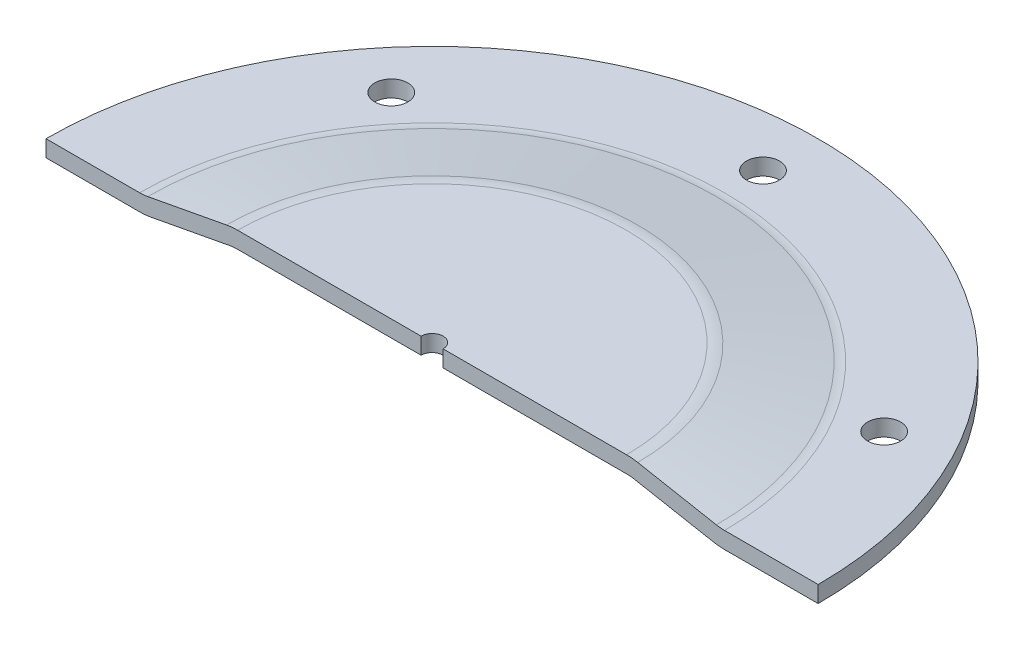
from build123d import *

# Parameters (mm, degrees)
ENL_V_MAT_EXTRU_2_REACH      = 72.848
ESQUISSE5_R                  = 1.5
R_P_TITION_CIRCULAIRE1_COUNT = 2
R_P_TITION_CIRCULAIRE1_ANGLE = 60
R_P_TITION_CIRCULAIRE2_COUNT = 2
R_P_TITION_CIRCULAIRE2_ANGLE = 50
ENL_V_MAT_EXTRU_3_REACH      = 51.588
ESQUISSE6_R                  = 1
ESQUISSE2_W                  = 35
ESQUISSE2_H                  = 3
COUPE_ANGLE                  = 180


with BuildPart() as part:
    # Esquisse1 → R_volution1 (revolve)
    with BuildSketch(Plane.XY):
        with BuildLine():
            Line((-35, 0), (-26.511171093, 0))
            ThreePointArc((-26.511171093, 0), (-26.141005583, 0.017164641), (-25.774016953, 0.068511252))
            Line((-25.774016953, 0.068511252), (-18.641826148, 1.405797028))
            ThreePointArc((-18.641826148, 1.405797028), (-18.137216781, 1.476398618), (-17.628239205, 1.5))
            Line((-17.628239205, 1.5), (0, 1.5))
            Line((0, 1.5), (0, 0))
            Line((0, 0), (-17.628239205, 0))
            ThreePointArc((-17.628239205, 0), (-17.998404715, -0.017164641), (-18.365393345, -0.068511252))
            Line((-18.365393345, -0.068511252), (-25.49758415, -1.405797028))
            ThreePointArc((-25.49758415, -1.405797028), (-26.002193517, -1.476398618), (-26.511171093, -1.5))
            Line((-26.511171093, -1.5), (-35, -1.5))
            Line((-35, -1.5), (-35, 0))
        make_face()
    revolve(axis=Axis((0, 1.5, 0), (0, 1, 0)))

    # Esquisse5 → Enl_v. mat.-Extru.2 (cut, up to next)
    with BuildSketch(Plane(origin=(-9.442910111, 0, -20.154109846), x_dir=(-1, 0, 0), z_dir=(0, 1, 0)), mode=Mode.PRIVATE) as enl_v_mat_extru_2_sk1:
        with Locations(Location((-9.442910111, -9.845890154, 0), (0, 0, 90))):
            Circle(ESQUISSE5_R)
    enl_v_mat_extru_2_tool1 = extrude(enl_v_mat_extru_2_sk1.sketch, amount=-ENL_V_MAT_EXTRU_2_REACH, mode=Mode.PRIVATE) & part.part
    enl_v_mat_extru_2 = enl_v_mat_extru_2_tool1.solids().sort_by_distance((0, 0, -30))[0]
    add(enl_v_mat_extru_2, mode=Mode.SUBTRACT)

    # R_p_tition circulaire1: Enl_v. mat.-Extru.2 ×2 about axis
    r_p_tition_circulaire1_axis = Axis((0, 0, 0), (0, -1, 0))
    for i in range(1, R_P_TITION_CIRCULAIRE1_COUNT):
        add(enl_v_mat_extru_2.rotate(r_p_tition_circulaire1_axis, i * R_P_TITION_CIRCULAIRE1_ANGLE / (R_P_TITION_CIRCULAIRE1_COUNT - 1)), mode=Mode.SUBTRACT)

    # R_p_tition circulaire2: Enl_v. mat.-Extru.2 ×2 about axis
    r_p_tition_circulaire2_axis = Axis((0, 0, 0), (0, 1, 0))
    for i in range(1, R_P_TITION_CIRCULAIRE2_COUNT):
        add(enl_v_mat_extru_2.rotate(r_p_tition_circulaire2_axis, i * R_P_TITION_CIRCULAIRE2_ANGLE / (R_P_TITION_CIRCULAIRE2_COUNT - 1)), mode=Mode.SUBTRACT)

    # Sym_trie2: Enl_v. mat.-Extru.2 across plane
    add(enl_v_mat_extru_2.mirror(Plane.XY), mode=Mode.SUBTRACT)

    # Esquisse6 → Enl_v. mat.-Extru.3 (cut, up to next)
    with BuildSketch(Plane(origin=(0, 1.5, 0), x_dir=(-1, 0, 0), z_dir=(0, 1, 0)), mode=Mode.PRIVATE) as enl_v_mat_extru_3_sk1:
        Circle(ESQUISSE6_R)
    enl_v_mat_extru_3_tool1 = extrude(enl_v_mat_extru_3_sk1.sketch, amount=-ENL_V_MAT_EXTRU_3_REACH, mode=Mode.PRIVATE) & part.part
    add(enl_v_mat_extru_3_tool1.solids().sort_by_distance((0, 1.5, 0))[0], mode=Mode.SUBTRACT)

    # Esquisse2 → Coupe (revolve, cut)
    with BuildSketch(Plane.XY):
        with Locations((17.5, 0)):
            Rectangle(ESQUISSE2_W, ESQUISSE2_H)
    revolve(axis=Axis((0, 1.5, 0), (0, -1, 0)), revolution_arc=COUPE_ANGLE, mode=Mode.SUBTRACT)


solid = part.part
